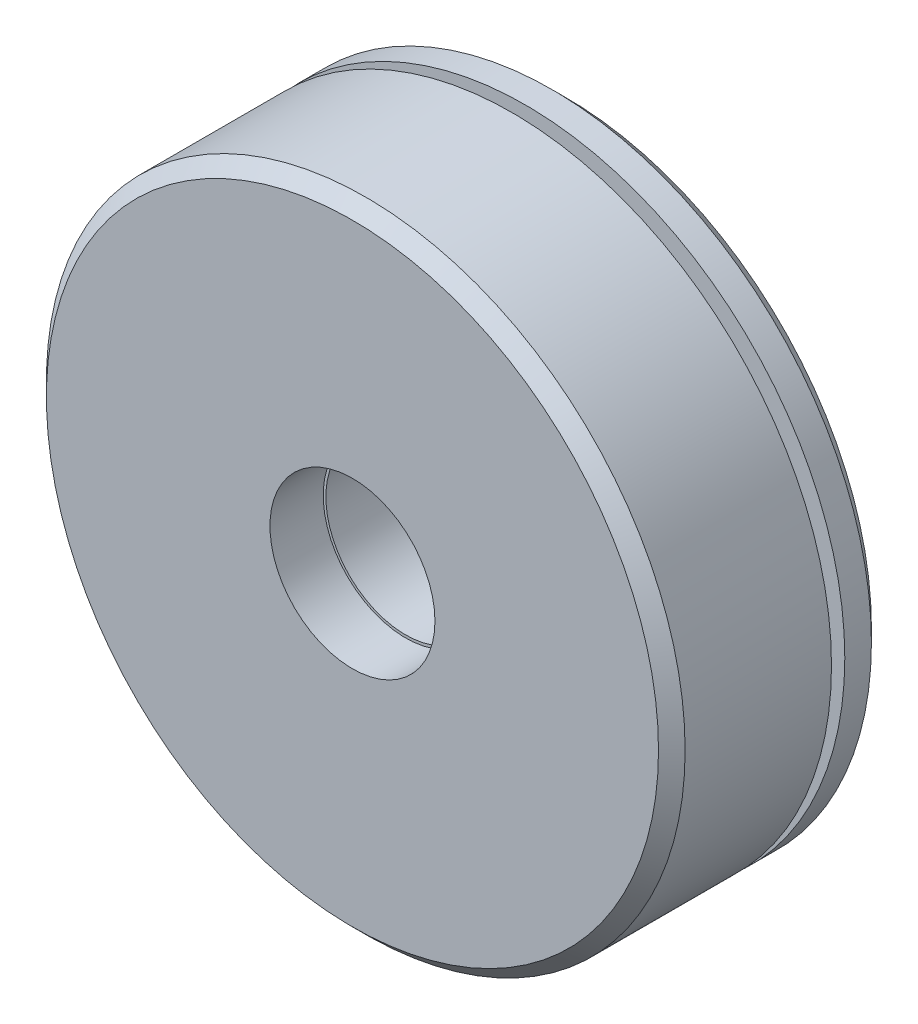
ISO-10303-21;
HEADER;
FILE_DESCRIPTION(('STEP AP214'),'2;1');
FILE_NAME('part.step','',(''),(''),'','','');
FILE_SCHEMA(('AUTOMOTIVE_DESIGN { 1 0 10303 214 1 1 1 1 }'));
ENDSEC;
DATA;
#1=APPLICATION_CONTEXT('core data for automotive mechanical design processes');
#2=APPLICATION_PROTOCOL_DEFINITION('international standard','automotive_design',2000,#1);
#3=PRODUCT_CONTEXT('',#1,'mechanical');
#4=PRODUCT('Part','Part','',(#3));
#5=PRODUCT_RELATED_PRODUCT_CATEGORY('part','',(#4));
#6=PRODUCT_DEFINITION_FORMATION('','',#4);
#7=PRODUCT_DEFINITION_CONTEXT('part definition',#1,'design');
#8=PRODUCT_DEFINITION('design','',#6,#7);
#9=PRODUCT_DEFINITION_SHAPE('','',#8);
#10=(LENGTH_UNIT() NAMED_UNIT(*) SI_UNIT(.MILLI.,.METRE.));
#11=(NAMED_UNIT(*) PLANE_ANGLE_UNIT() SI_UNIT($,.RADIAN.));
#12=(NAMED_UNIT(*) SI_UNIT($,.STERADIAN.) SOLID_ANGLE_UNIT());
#13=UNCERTAINTY_MEASURE_WITH_UNIT(LENGTH_MEASURE(1.E-05),#10,'distance_accuracy_value','');
#14=(GEOMETRIC_REPRESENTATION_CONTEXT(3) GLOBAL_UNCERTAINTY_ASSIGNED_CONTEXT((#13)) GLOBAL_UNIT_ASSIGNED_CONTEXT((#10,
#11,#12)) REPRESENTATION_CONTEXT('',''));
#15=CARTESIAN_POINT('',(0.,0.,0.));
#16=DIRECTION('',(0.,0.,1.));
#17=DIRECTION('',(1.,0.,0.));
#18=AXIS2_PLACEMENT_3D('',#15,#16,#17);
#19=CARTESIAN_POINT('',(0.,0.,7.5));
#20=DIRECTION('',(0.,0.,-1.));
#21=DIRECTION('',(-1.,0.,0.));
#22=AXIS2_PLACEMENT_3D('',#19,#20,#21);
#23=CONICAL_SURFACE('',#22,12.,0.785398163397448);
#24=CARTESIAN_POINT('',(0.,0.,8.));
#25=DIRECTION('',(0.,0.,1.));
#26=DIRECTION('',(1.,0.,0.));
#27=AXIS2_PLACEMENT_3D('',#24,#25,#26);
#28=CIRCLE('',#27,11.5);
#29=CARTESIAN_POINT('',(11.5,0.,8.));
#30=VERTEX_POINT('',#29);
#31=EDGE_CURVE('E8',#30,#30,#28,.T.);
#32=ORIENTED_EDGE('',*,*,#31,.F.);
#33=EDGE_LOOP('',(#32));
#34=FACE_BOUND('',#33,.T.);
#35=CARTESIAN_POINT('',(0.,0.,7.5));
#36=DIRECTION('',(0.,0.,1.));
#37=DIRECTION('',(1.,0.,0.));
#38=AXIS2_PLACEMENT_3D('',#35,#36,#37);
#39=CIRCLE('',#38,12.);
#40=CARTESIAN_POINT('',(12.,0.,7.5));
#41=VERTEX_POINT('',#40);
#42=EDGE_CURVE('E59',#41,#41,#39,.T.);
#43=ORIENTED_EDGE('',*,*,#42,.T.);
#44=EDGE_LOOP('',(#43));
#45=FACE_BOUND('',#44,.T.);
#46=ADVANCED_FACE('F13',(#34,#45),#23,.T.);
#47=CARTESIAN_POINT('',(0.,11.5,8.));
#48=DIRECTION('',(0.,0.,-1.));
#49=DIRECTION('',(-1.,0.,0.));
#50=AXIS2_PLACEMENT_3D('',#47,#48,#49);
#51=PLANE('',#50);
#52=CARTESIAN_POINT('',(0.,0.,8.));
#53=DIRECTION('',(0.,0.,1.));
#54=DIRECTION('',(1.,0.,0.));
#55=AXIS2_PLACEMENT_3D('',#52,#53,#54);
#56=CIRCLE('',#55,3.1);
#57=CARTESIAN_POINT('',(3.1,0.,8.));
#58=VERTEX_POINT('',#57);
#59=EDGE_CURVE('E19',#58,#58,#56,.T.);
#60=ORIENTED_EDGE('',*,*,#59,.F.);
#61=EDGE_LOOP('',(#60));
#62=FACE_BOUND('',#61,.T.);
#63=ORIENTED_EDGE('',*,*,#31,.T.);
#64=EDGE_LOOP('',(#63));
#65=FACE_BOUND('',#64,.T.);
#66=ADVANCED_FACE('F132',(#62,#65),#51,.F.);
#67=CARTESIAN_POINT('',(0.,0.,0.));
#68=DIRECTION('',(0.,0.,1.));
#69=DIRECTION('',(1.,0.,0.));
#70=AXIS2_PLACEMENT_3D('',#67,#68,#69);
#71=CYLINDRICAL_SURFACE('',#70,3.1);
#72=CARTESIAN_POINT('',(0.,0.,6.));
#73=DIRECTION('',(0.,0.,1.));
#74=DIRECTION('',(1.,0.,0.));
#75=AXIS2_PLACEMENT_3D('',#72,#73,#74);
#76=CIRCLE('',#75,3.1);
#77=CARTESIAN_POINT('',(3.1,0.,6.));
#78=VERTEX_POINT('',#77);
#79=EDGE_CURVE('E23',#78,#78,#76,.T.);
#80=ORIENTED_EDGE('',*,*,#79,.F.);
#81=EDGE_LOOP('',(#80));
#82=FACE_BOUND('',#81,.T.);
#83=ORIENTED_EDGE('',*,*,#59,.T.);
#84=EDGE_LOOP('',(#83));
#85=FACE_BOUND('',#84,.T.);
#86=ADVANCED_FACE('F127',(#82,#85),#71,.F.);
#87=CARTESIAN_POINT('',(0.,3.1,6.));
#88=DIRECTION('',(0.,0.,-1.));
#89=DIRECTION('',(-1.,0.,0.));
#90=AXIS2_PLACEMENT_3D('',#87,#88,#89);
#91=PLANE('',#90);
#92=CARTESIAN_POINT('',(0.,0.,6.));
#93=DIRECTION('',(0.,0.,1.));
#94=DIRECTION('',(1.,0.,0.));
#95=AXIS2_PLACEMENT_3D('',#92,#93,#94);
#96=CIRCLE('',#95,3.);
#97=CARTESIAN_POINT('',(3.,0.,6.));
#98=VERTEX_POINT('',#97);
#99=EDGE_CURVE('E27',#98,#98,#96,.T.);
#100=ORIENTED_EDGE('',*,*,#99,.F.);
#101=EDGE_LOOP('',(#100));
#102=FACE_BOUND('',#101,.T.);
#103=ORIENTED_EDGE('',*,*,#79,.T.);
#104=EDGE_LOOP('',(#103));
#105=FACE_BOUND('',#104,.T.);
#106=ADVANCED_FACE('F121',(#102,#105),#91,.F.);
#107=CARTESIAN_POINT('',(0.,0.,0.));
#108=DIRECTION('',(0.,0.,1.));
#109=DIRECTION('',(1.,0.,0.));
#110=AXIS2_PLACEMENT_3D('',#107,#108,#109);
#111=CYLINDRICAL_SURFACE('',#110,3.);
#112=CARTESIAN_POINT('',(0.,0.,2.));
#113=DIRECTION('',(0.,0.,1.));
#114=DIRECTION('',(1.,0.,0.));
#115=AXIS2_PLACEMENT_3D('',#112,#113,#114);
#116=CIRCLE('',#115,3.);
#117=CARTESIAN_POINT('',(3.,0.,2.));
#118=VERTEX_POINT('',#117);
#119=EDGE_CURVE('E32',#118,#118,#116,.T.);
#120=ORIENTED_EDGE('',*,*,#119,.F.);
#121=EDGE_LOOP('',(#120));
#122=FACE_BOUND('',#121,.T.);
#123=ORIENTED_EDGE('',*,*,#99,.T.);
#124=EDGE_LOOP('',(#123));
#125=FACE_BOUND('',#124,.T.);
#126=ADVANCED_FACE('F115',(#122,#125),#111,.F.);
#127=CARTESIAN_POINT('',(0.,3.,2.));
#128=DIRECTION('',(0.,0.,1.));
#129=DIRECTION('',(1.,0.,0.));
#130=AXIS2_PLACEMENT_3D('',#127,#128,#129);
#131=PLANE('',#130);
#132=CARTESIAN_POINT('',(0.,0.,2.));
#133=DIRECTION('',(0.,0.,1.));
#134=DIRECTION('',(1.,0.,0.));
#135=AXIS2_PLACEMENT_3D('',#132,#133,#134);
#136=CIRCLE('',#135,3.1);
#137=CARTESIAN_POINT('',(3.1,0.,2.));
#138=VERTEX_POINT('',#137);
#139=EDGE_CURVE('E35',#138,#138,#136,.T.);
#140=ORIENTED_EDGE('',*,*,#139,.F.);
#141=EDGE_LOOP('',(#140));
#142=FACE_BOUND('',#141,.T.);
#143=ORIENTED_EDGE('',*,*,#119,.T.);
#144=EDGE_LOOP('',(#143));
#145=FACE_BOUND('',#144,.T.);
#146=ADVANCED_FACE('F109',(#142,#145),#131,.F.);
#147=CARTESIAN_POINT('',(0.,0.,0.));
#148=DIRECTION('',(0.,0.,1.));
#149=DIRECTION('',(1.,0.,0.));
#150=AXIS2_PLACEMENT_3D('',#147,#148,#149);
#151=CYLINDRICAL_SURFACE('',#150,3.1);
#152=CARTESIAN_POINT('',(0.,0.,0.));
#153=DIRECTION('',(0.,0.,1.));
#154=DIRECTION('',(1.,0.,0.));
#155=AXIS2_PLACEMENT_3D('',#152,#153,#154);
#156=CIRCLE('',#155,3.1);
#157=CARTESIAN_POINT('',(3.1,0.,0.));
#158=VERTEX_POINT('',#157);
#159=EDGE_CURVE('E38',#158,#158,#156,.T.);
#160=ORIENTED_EDGE('',*,*,#159,.F.);
#161=EDGE_LOOP('',(#160));
#162=FACE_BOUND('',#161,.T.);
#163=ORIENTED_EDGE('',*,*,#139,.T.);
#164=EDGE_LOOP('',(#163));
#165=FACE_BOUND('',#164,.T.);
#166=ADVANCED_FACE('F103',(#162,#165),#151,.F.);
#167=CARTESIAN_POINT('',(0.,3.1,0.));
#168=DIRECTION('',(0.,0.,1.));
#169=DIRECTION('',(1.,0.,0.));
#170=AXIS2_PLACEMENT_3D('',#167,#168,#169);
#171=PLANE('',#170);
#172=CARTESIAN_POINT('',(0.,0.,0.));
#173=DIRECTION('',(0.,0.,1.));
#174=DIRECTION('',(1.,0.,0.));
#175=AXIS2_PLACEMENT_3D('',#172,#173,#174);
#176=CIRCLE('',#175,11.5);
#177=CARTESIAN_POINT('',(11.5,0.,0.));
#178=VERTEX_POINT('',#177);
#179=EDGE_CURVE('E41',#178,#178,#176,.T.);
#180=ORIENTED_EDGE('',*,*,#179,.F.);
#181=EDGE_LOOP('',(#180));
#182=FACE_BOUND('',#181,.T.);
#183=ORIENTED_EDGE('',*,*,#159,.T.);
#184=EDGE_LOOP('',(#183));
#185=FACE_BOUND('',#184,.T.);
#186=ADVANCED_FACE('F97',(#182,#185),#171,.F.);
#187=CARTESIAN_POINT('',(0.,0.,0.));
#188=DIRECTION('',(0.,0.,1.));
#189=DIRECTION('',(1.,0.,0.));
#190=AXIS2_PLACEMENT_3D('',#187,#188,#189);
#191=CONICAL_SURFACE('',#190,11.5,0.785398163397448);
#192=CARTESIAN_POINT('',(0.,0.,0.5));
#193=DIRECTION('',(0.,0.,1.));
#194=DIRECTION('',(1.,0.,0.));
#195=AXIS2_PLACEMENT_3D('',#192,#193,#194);
#196=CIRCLE('',#195,12.);
#197=CARTESIAN_POINT('',(12.,0.,0.5));
#198=VERTEX_POINT('',#197);
#199=EDGE_CURVE('E44',#198,#198,#196,.T.);
#200=ORIENTED_EDGE('',*,*,#199,.F.);
#201=EDGE_LOOP('',(#200));
#202=FACE_BOUND('',#201,.T.);
#203=ORIENTED_EDGE('',*,*,#179,.T.);
#204=EDGE_LOOP('',(#203));
#205=FACE_BOUND('',#204,.T.);
#206=ADVANCED_FACE('F91',(#202,#205),#191,.T.);
#207=CARTESIAN_POINT('',(0.,0.,0.));
#208=DIRECTION('',(0.,0.,1.));
#209=DIRECTION('',(1.,0.,0.));
#210=AXIS2_PLACEMENT_3D('',#207,#208,#209);
#211=CYLINDRICAL_SURFACE('',#210,12.);
#212=CARTESIAN_POINT('',(0.,0.,1.5));
#213=DIRECTION('',(0.,0.,1.));
#214=DIRECTION('',(1.,0.,0.));
#215=AXIS2_PLACEMENT_3D('',#212,#213,#214);
#216=CIRCLE('',#215,12.);
#217=CARTESIAN_POINT('',(12.,0.,1.5));
#218=VERTEX_POINT('',#217);
#219=EDGE_CURVE('E47',#218,#218,#216,.T.);
#220=ORIENTED_EDGE('',*,*,#219,.F.);
#221=EDGE_LOOP('',(#220));
#222=FACE_BOUND('',#221,.T.);
#223=ORIENTED_EDGE('',*,*,#199,.T.);
#224=EDGE_LOOP('',(#223));
#225=FACE_BOUND('',#224,.T.);
#226=ADVANCED_FACE('F85',(#222,#225),#211,.T.);
#227=CARTESIAN_POINT('',(0.,12.,1.5));
#228=DIRECTION('',(0.,0.,-1.));
#229=DIRECTION('',(-1.,0.,0.));
#230=AXIS2_PLACEMENT_3D('',#227,#228,#229);
#231=PLANE('',#230);
#232=CARTESIAN_POINT('',(0.,0.,1.5));
#233=DIRECTION('',(0.,0.,1.));
#234=DIRECTION('',(1.,0.,0.));
#235=AXIS2_PLACEMENT_3D('',#232,#233,#234);
#236=CIRCLE('',#235,10.6);
#237=CARTESIAN_POINT('',(10.6,0.,1.5));
#238=VERTEX_POINT('',#237);
#239=EDGE_CURVE('E50',#238,#238,#236,.T.);
#240=ORIENTED_EDGE('',*,*,#239,.F.);
#241=EDGE_LOOP('',(#240));
#242=FACE_BOUND('',#241,.T.);
#243=ORIENTED_EDGE('',*,*,#219,.T.);
#244=EDGE_LOOP('',(#243));
#245=FACE_BOUND('',#244,.T.);
#246=ADVANCED_FACE('F79',(#242,#245),#231,.F.);
#247=CARTESIAN_POINT('',(0.,0.,0.));
#248=DIRECTION('',(0.,0.,1.));
#249=DIRECTION('',(1.,0.,0.));
#250=AXIS2_PLACEMENT_3D('',#247,#248,#249);
#251=CYLINDRICAL_SURFACE('',#250,10.6);
#252=CARTESIAN_POINT('',(0.,0.,2.));
#253=DIRECTION('',(0.,0.,1.));
#254=DIRECTION('',(1.,0.,0.));
#255=AXIS2_PLACEMENT_3D('',#252,#253,#254);
#256=CIRCLE('',#255,10.6);
#257=CARTESIAN_POINT('',(10.6,0.,2.));
#258=VERTEX_POINT('',#257);
#259=EDGE_CURVE('E53',#258,#258,#256,.T.);
#260=ORIENTED_EDGE('',*,*,#259,.F.);
#261=EDGE_LOOP('',(#260));
#262=FACE_BOUND('',#261,.T.);
#263=ORIENTED_EDGE('',*,*,#239,.T.);
#264=EDGE_LOOP('',(#263));
#265=FACE_BOUND('',#264,.T.);
#266=ADVANCED_FACE('F73',(#262,#265),#251,.T.);
#267=CARTESIAN_POINT('',(0.,10.6,2.));
#268=DIRECTION('',(0.,0.,1.));
#269=DIRECTION('',(1.,0.,0.));
#270=AXIS2_PLACEMENT_3D('',#267,#268,#269);
#271=PLANE('',#270);
#272=CARTESIAN_POINT('',(0.,0.,2.));
#273=DIRECTION('',(0.,0.,1.));
#274=DIRECTION('',(1.,0.,0.));
#275=AXIS2_PLACEMENT_3D('',#272,#273,#274);
#276=CIRCLE('',#275,12.);
#277=CARTESIAN_POINT('',(12.,0.,2.));
#278=VERTEX_POINT('',#277);
#279=EDGE_CURVE('E56',#278,#278,#276,.T.);
#280=ORIENTED_EDGE('',*,*,#279,.F.);
#281=EDGE_LOOP('',(#280));
#282=FACE_BOUND('',#281,.T.);
#283=ORIENTED_EDGE('',*,*,#259,.T.);
#284=EDGE_LOOP('',(#283));
#285=FACE_BOUND('',#284,.T.);
#286=ADVANCED_FACE('F67',(#282,#285),#271,.F.);
#287=CARTESIAN_POINT('',(0.,0.,0.));
#288=DIRECTION('',(0.,0.,1.));
#289=DIRECTION('',(1.,0.,0.));
#290=AXIS2_PLACEMENT_3D('',#287,#288,#289);
#291=CYLINDRICAL_SURFACE('',#290,12.);
#292=ORIENTED_EDGE('',*,*,#42,.F.);
#293=EDGE_LOOP('',(#292));
#294=FACE_BOUND('',#293,.T.);
#295=ORIENTED_EDGE('',*,*,#279,.T.);
#296=EDGE_LOOP('',(#295));
#297=FACE_BOUND('',#296,.T.);
#298=ADVANCED_FACE('F64',(#294,#297),#291,.T.);
#299=CLOSED_SHELL('',(#46,#66,#86,#106,#126,#146,#166,#186,#206,#226,#246,#266,#286,#298));
#300=MANIFOLD_SOLID_BREP('B1',#299);
#301=ADVANCED_BREP_SHAPE_REPRESENTATION('',(#18,#300),#14);
#302=SHAPE_DEFINITION_REPRESENTATION(#9,#301);
ENDSEC;
END-ISO-10303-21;
